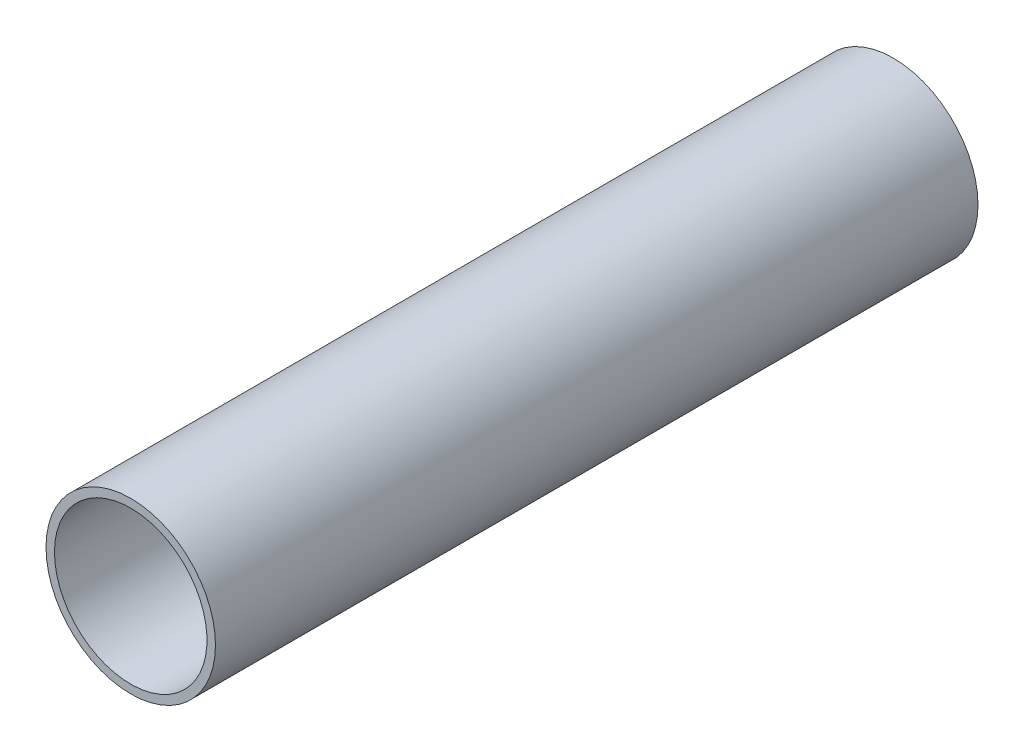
ISO-10303-21;
HEADER;
FILE_DESCRIPTION(('STEP AP214'),'2;1');
FILE_NAME('part.step','',(''),(''),'','','');
FILE_SCHEMA(('AUTOMOTIVE_DESIGN { 1 0 10303 214 1 1 1 1 }'));
ENDSEC;
DATA;
#1=APPLICATION_CONTEXT('core data for automotive mechanical design processes');
#2=APPLICATION_PROTOCOL_DEFINITION('international standard','automotive_design',2000,#1);
#3=PRODUCT_CONTEXT('',#1,'mechanical');
#4=PRODUCT('Part','Part','',(#3));
#5=PRODUCT_RELATED_PRODUCT_CATEGORY('part','',(#4));
#6=PRODUCT_DEFINITION_FORMATION('','',#4);
#7=PRODUCT_DEFINITION_CONTEXT('part definition',#1,'design');
#8=PRODUCT_DEFINITION('design','',#6,#7);
#9=PRODUCT_DEFINITION_SHAPE('','',#8);
#10=(LENGTH_UNIT() NAMED_UNIT(*) SI_UNIT(.MILLI.,.METRE.));
#11=(NAMED_UNIT(*) PLANE_ANGLE_UNIT() SI_UNIT($,.RADIAN.));
#12=(NAMED_UNIT(*) SI_UNIT($,.STERADIAN.) SOLID_ANGLE_UNIT());
#13=UNCERTAINTY_MEASURE_WITH_UNIT(LENGTH_MEASURE(1.E-05),#10,'distance_accuracy_value','');
#14=(GEOMETRIC_REPRESENTATION_CONTEXT(3) GLOBAL_UNCERTAINTY_ASSIGNED_CONTEXT((#13)) GLOBAL_UNIT_ASSIGNED_CONTEXT((#10,
#11,#12)) REPRESENTATION_CONTEXT('',''));
#15=CARTESIAN_POINT('',(0.,0.,0.));
#16=DIRECTION('',(0.,0.,1.));
#17=DIRECTION('',(1.,0.,0.));
#18=AXIS2_PLACEMENT_3D('',#15,#16,#17);
#19=CARTESIAN_POINT('',(0.,0.,22.5));
#20=DIRECTION('',(0.,0.,1.));
#21=DIRECTION('',(1.,0.,0.));
#22=AXIS2_PLACEMENT_3D('',#19,#20,#21);
#23=PLANE('',#22);
#24=CARTESIAN_POINT('',(0.,0.,22.5));
#25=DIRECTION('',(0.,0.,1.));
#26=DIRECTION('',(1.,0.,0.));
#27=AXIS2_PLACEMENT_3D('',#24,#25,#26);
#28=CIRCLE('',#27,5.);
#29=CARTESIAN_POINT('',(-5.,0.,22.5));
#30=VERTEX_POINT('',#29);
#31=EDGE_CURVE('E10',#30,#30,#28,.T.);
#32=ORIENTED_EDGE('',*,*,#31,.T.);
#33=EDGE_LOOP('',(#32));
#34=FACE_BOUND('',#33,.T.);
#35=CARTESIAN_POINT('',(0.,0.,22.5));
#36=DIRECTION('',(0.,0.,1.));
#37=DIRECTION('',(1.,0.,0.));
#38=AXIS2_PLACEMENT_3D('',#35,#36,#37);
#39=CIRCLE('',#38,4.5);
#40=CARTESIAN_POINT('',(-4.5,0.,22.5));
#41=VERTEX_POINT('',#40);
#42=EDGE_CURVE('E38',#41,#41,#39,.T.);
#43=ORIENTED_EDGE('',*,*,#42,.F.);
#44=EDGE_LOOP('',(#43));
#45=FACE_BOUND('',#44,.T.);
#46=ADVANCED_FACE('F31',(#34,#45),#23,.T.);
#47=CARTESIAN_POINT('',(0.,0.,22.5));
#48=DIRECTION('',(0.,0.,-1.));
#49=DIRECTION('',(-1.,0.,0.));
#50=AXIS2_PLACEMENT_3D('',#47,#48,#49);
#51=CYLINDRICAL_SURFACE('',#50,5.);
#52=CARTESIAN_POINT('',(0.,0.,-22.5));
#53=DIRECTION('',(0.,0.,1.));
#54=DIRECTION('',(1.,0.,0.));
#55=AXIS2_PLACEMENT_3D('',#52,#53,#54);
#56=CIRCLE('',#55,5.);
#57=CARTESIAN_POINT('',(-5.,0.,-22.5));
#58=VERTEX_POINT('',#57);
#59=EDGE_CURVE('E42',#58,#58,#56,.T.);
#60=CARTESIAN_POINT('',(-5.,0.,22.5));
#61=CARTESIAN_POINT('',(-5.,0.,22.03125));
#62=CARTESIAN_POINT('',(-5.,0.,21.5625));
#63=CARTESIAN_POINT('',(-5.,0.,20.625));
#64=CARTESIAN_POINT('',(-5.,0.,20.15625));
#65=CARTESIAN_POINT('',(-5.,0.,19.21875));
#66=CARTESIAN_POINT('',(-5.,0.,18.75));
#67=CARTESIAN_POINT('',(-5.,0.,17.8125));
#68=CARTESIAN_POINT('',(-5.,0.,17.34375));
#69=CARTESIAN_POINT('',(-5.,0.,16.40625));
#70=CARTESIAN_POINT('',(-5.,0.,15.9375));
#71=CARTESIAN_POINT('',(-5.,0.,15.));
#72=CARTESIAN_POINT('',(-5.,0.,14.53125));
#73=CARTESIAN_POINT('',(-5.,0.,13.59375));
#74=CARTESIAN_POINT('',(-5.,0.,13.125));
#75=CARTESIAN_POINT('',(-5.,0.,12.1875));
#76=CARTESIAN_POINT('',(-5.,0.,11.71875));
#77=CARTESIAN_POINT('',(-5.,0.,10.78125));
#78=CARTESIAN_POINT('',(-5.,0.,10.3125));
#79=CARTESIAN_POINT('',(-5.,0.,9.37499999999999));
#80=CARTESIAN_POINT('',(-5.,0.,8.90625));
#81=CARTESIAN_POINT('',(-5.,0.,7.96874999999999));
#82=CARTESIAN_POINT('',(-5.,0.,7.5));
#83=CARTESIAN_POINT('',(-5.,0.,6.5625));
#84=CARTESIAN_POINT('',(-5.,0.,6.09374999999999));
#85=CARTESIAN_POINT('',(-5.,0.,5.15624999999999));
#86=CARTESIAN_POINT('',(-5.,0.,4.68749999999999));
#87=CARTESIAN_POINT('',(-5.,0.,3.74999999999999));
#88=CARTESIAN_POINT('',(-5.,0.,3.28124999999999));
#89=CARTESIAN_POINT('',(-5.,0.,2.34375));
#90=CARTESIAN_POINT('',(-5.,0.,1.87499999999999));
#91=CARTESIAN_POINT('',(-5.,0.,0.937499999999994));
#92=CARTESIAN_POINT('',(-5.,0.,0.468749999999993));
#93=CARTESIAN_POINT('',(-5.,0.,-0.468750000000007));
#94=CARTESIAN_POINT('',(-5.,0.,-0.937500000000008));
#95=CARTESIAN_POINT('',(-5.,0.,-1.87500000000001));
#96=CARTESIAN_POINT('',(-5.,0.,-2.34375000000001));
#97=CARTESIAN_POINT('',(-5.,0.,-3.28125000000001));
#98=CARTESIAN_POINT('',(-5.,0.,-3.75000000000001));
#99=CARTESIAN_POINT('',(-5.,0.,-4.68750000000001));
#100=CARTESIAN_POINT('',(-5.,0.,-5.15625000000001));
#101=CARTESIAN_POINT('',(-5.,0.,-6.09375000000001));
#102=CARTESIAN_POINT('',(-5.,0.,-6.56250000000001));
#103=CARTESIAN_POINT('',(-5.,0.,-7.50000000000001));
#104=CARTESIAN_POINT('',(-5.,0.,-7.96875000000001));
#105=CARTESIAN_POINT('',(-5.,0.,-8.90625000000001));
#106=CARTESIAN_POINT('',(-5.,0.,-9.37500000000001));
#107=CARTESIAN_POINT('',(-5.,0.,-10.3125));
#108=CARTESIAN_POINT('',(-5.,0.,-10.78125));
#109=CARTESIAN_POINT('',(-5.,0.,-11.71875));
#110=CARTESIAN_POINT('',(-5.,0.,-12.1875));
#111=CARTESIAN_POINT('',(-5.,0.,-13.125));
#112=CARTESIAN_POINT('',(-5.,0.,-13.59375));
#113=CARTESIAN_POINT('',(-5.,0.,-14.53125));
#114=CARTESIAN_POINT('',(-5.,0.,-15.));
#115=CARTESIAN_POINT('',(-5.,0.,-15.9375));
#116=CARTESIAN_POINT('',(-5.,0.,-16.40625));
#117=CARTESIAN_POINT('',(-5.,0.,-17.34375));
#118=CARTESIAN_POINT('',(-5.,0.,-17.8125));
#119=CARTESIAN_POINT('',(-5.,0.,-18.75));
#120=CARTESIAN_POINT('',(-5.,0.,-19.21875));
#121=CARTESIAN_POINT('',(-5.,0.,-20.15625));
#122=CARTESIAN_POINT('',(-5.,0.,-20.625));
#123=CARTESIAN_POINT('',(-5.,0.,-21.5625));
#124=CARTESIAN_POINT('',(-5.,0.,-22.03125));
#125=CARTESIAN_POINT('',(-5.,0.,-22.5));
#126=B_SPLINE_CURVE_WITH_KNOTS('',3,(#60,#61,#62,#63,#64,#65,#66,#67,#68,#69,#70,#71,#72,#73,
#74,#75,#76,#77,#78,#79,#80,#81,#82,#83,#84,#85,#86,#87,#88,#89,#90,#91,#92,#93,#94,#95,#96,#97,
#98,#99,#100,#101,#102,#103,#104,#105,#106,#107,#108,#109,#110,#111,#112,#113,#114,#115,#116,
#117,#118,#119,#120,#121,#122,#123,#124,#125),.UNSPECIFIED.,.F.,.F.,(4,2,2,2,2,2,2,2,2,2,2,2,2,
2,2,2,2,2,2,2,2,2,2,2,2,2,2,2,2,2,2,2,4),(0.,1.40625,2.8125,4.21875,5.625,7.03125,8.4375,
9.84375,11.25,12.65625,14.0625,15.46875,16.875,18.28125,19.6875,21.09375,22.5,23.90625,25.3125,
26.71875,28.125,29.53125,30.9375,32.34375,33.75,35.15625,36.5625,37.96875,39.375,40.78125,
42.1875,43.59375,45.),.UNSPECIFIED.);
#127=EDGE_CURVE('BSEAM33',#30,#58,#126,.T.);
#128=ORIENTED_EDGE('',*,*,#31,.F.);
#129=ORIENTED_EDGE('',*,*,#59,.T.);
#130=ORIENTED_EDGE('',*,*,#127,.T.);
#131=ORIENTED_EDGE('',*,*,#127,.F.);
#132=EDGE_LOOP('',(#128,#130,#129,#131));
#133=FACE_BOUND('',#132,.T.);
#134=ADVANCED_FACE('F33',(#133),#51,.T.);
#135=CARTESIAN_POINT('',(0.,0.,22.5));
#136=DIRECTION('',(0.,0.,-1.));
#137=DIRECTION('',(-1.,0.,0.));
#138=AXIS2_PLACEMENT_3D('',#135,#136,#137);
#139=CYLINDRICAL_SURFACE('',#138,4.5);
#140=CARTESIAN_POINT('',(0.,0.,-22.5));
#141=DIRECTION('',(0.,0.,1.));
#142=DIRECTION('',(1.,0.,0.));
#143=AXIS2_PLACEMENT_3D('',#140,#141,#142);
#144=CIRCLE('',#143,4.5);
#145=CARTESIAN_POINT('',(-4.5,0.,-22.5));
#146=VERTEX_POINT('',#145);
#147=EDGE_CURVE('E46',#146,#146,#144,.T.);
#148=CARTESIAN_POINT('',(-4.5,0.,22.5));
#149=CARTESIAN_POINT('',(-4.5,0.,22.03125));
#150=CARTESIAN_POINT('',(-4.5,0.,21.5625));
#151=CARTESIAN_POINT('',(-4.5,0.,20.625));
#152=CARTESIAN_POINT('',(-4.5,0.,20.15625));
#153=CARTESIAN_POINT('',(-4.5,0.,19.21875));
#154=CARTESIAN_POINT('',(-4.5,0.,18.75));
#155=CARTESIAN_POINT('',(-4.5,0.,17.8125));
#156=CARTESIAN_POINT('',(-4.5,0.,17.34375));
#157=CARTESIAN_POINT('',(-4.5,0.,16.40625));
#158=CARTESIAN_POINT('',(-4.5,0.,15.9375));
#159=CARTESIAN_POINT('',(-4.5,0.,15.));
#160=CARTESIAN_POINT('',(-4.5,0.,14.53125));
#161=CARTESIAN_POINT('',(-4.5,0.,13.59375));
#162=CARTESIAN_POINT('',(-4.5,0.,13.125));
#163=CARTESIAN_POINT('',(-4.5,0.,12.1875));
#164=CARTESIAN_POINT('',(-4.5,0.,11.71875));
#165=CARTESIAN_POINT('',(-4.5,0.,10.78125));
#166=CARTESIAN_POINT('',(-4.5,0.,10.3125));
#167=CARTESIAN_POINT('',(-4.5,0.,9.37499999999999));
#168=CARTESIAN_POINT('',(-4.5,0.,8.90625));
#169=CARTESIAN_POINT('',(-4.5,0.,7.96874999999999));
#170=CARTESIAN_POINT('',(-4.5,0.,7.5));
#171=CARTESIAN_POINT('',(-4.5,0.,6.5625));
#172=CARTESIAN_POINT('',(-4.5,0.,6.09375));
#173=CARTESIAN_POINT('',(-4.5,0.,5.15625));
#174=CARTESIAN_POINT('',(-4.5,0.,4.6875));
#175=CARTESIAN_POINT('',(-4.5,0.,3.75));
#176=CARTESIAN_POINT('',(-4.5,0.,3.28125));
#177=CARTESIAN_POINT('',(-4.5,0.,2.34375));
#178=CARTESIAN_POINT('',(-4.5,0.,1.875));
#179=CARTESIAN_POINT('',(-4.5,0.,0.937499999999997));
#180=CARTESIAN_POINT('',(-4.5,0.,0.468749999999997));
#181=CARTESIAN_POINT('',(-4.5,0.,-0.468750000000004));
#182=CARTESIAN_POINT('',(-4.5,0.,-0.937500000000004));
#183=CARTESIAN_POINT('',(-4.5,0.,-1.87500000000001));
#184=CARTESIAN_POINT('',(-4.5,0.,-2.34375000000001));
#185=CARTESIAN_POINT('',(-4.5,0.,-3.28125));
#186=CARTESIAN_POINT('',(-4.5,0.,-3.75));
#187=CARTESIAN_POINT('',(-4.5,0.,-4.6875));
#188=CARTESIAN_POINT('',(-4.5,0.,-5.15625));
#189=CARTESIAN_POINT('',(-4.5,0.,-6.09375000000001));
#190=CARTESIAN_POINT('',(-4.5,0.,-6.56250000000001));
#191=CARTESIAN_POINT('',(-4.5,0.,-7.50000000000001));
#192=CARTESIAN_POINT('',(-4.5,0.,-7.96875000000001));
#193=CARTESIAN_POINT('',(-4.5,0.,-8.90625));
#194=CARTESIAN_POINT('',(-4.5,0.,-9.37500000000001));
#195=CARTESIAN_POINT('',(-4.5,0.,-10.3125));
#196=CARTESIAN_POINT('',(-4.5,0.,-10.78125));
#197=CARTESIAN_POINT('',(-4.5,0.,-11.71875));
#198=CARTESIAN_POINT('',(-4.5,0.,-12.1875));
#199=CARTESIAN_POINT('',(-4.5,0.,-13.125));
#200=CARTESIAN_POINT('',(-4.5,0.,-13.59375));
#201=CARTESIAN_POINT('',(-4.5,0.,-14.53125));
#202=CARTESIAN_POINT('',(-4.5,0.,-15.));
#203=CARTESIAN_POINT('',(-4.5,0.,-15.9375));
#204=CARTESIAN_POINT('',(-4.5,0.,-16.40625));
#205=CARTESIAN_POINT('',(-4.5,0.,-17.34375));
#206=CARTESIAN_POINT('',(-4.5,0.,-17.8125));
#207=CARTESIAN_POINT('',(-4.5,0.,-18.75));
#208=CARTESIAN_POINT('',(-4.5,0.,-19.21875));
#209=CARTESIAN_POINT('',(-4.5,0.,-20.15625));
#210=CARTESIAN_POINT('',(-4.5,0.,-20.625));
#211=CARTESIAN_POINT('',(-4.5,0.,-21.5625));
#212=CARTESIAN_POINT('',(-4.5,0.,-22.03125));
#213=CARTESIAN_POINT('',(-4.5,0.,-22.5));
#214=B_SPLINE_CURVE_WITH_KNOTS('',3,(#148,#149,#150,#151,#152,#153,#154,#155,#156,#157,#158,
#159,#160,#161,#162,#163,#164,#165,#166,#167,#168,#169,#170,#171,#172,#173,#174,#175,#176,#177,
#178,#179,#180,#181,#182,#183,#184,#185,#186,#187,#188,#189,#190,#191,#192,#193,#194,#195,#196,
#197,#198,#199,#200,#201,#202,#203,#204,#205,#206,#207,#208,#209,#210,#211,#212,#213),
.UNSPECIFIED.,.F.,.F.,(4,2,2,2,2,2,2,2,2,2,2,2,2,2,2,2,2,2,2,2,2,2,2,2,2,2,2,2,2,2,2,2,4),(0.,
1.40625,2.8125,4.21875,5.625,7.03125,8.4375,9.84375,11.25,12.65625,14.0625,15.46875,16.875,
18.28125,19.6875,21.09375,22.5,23.90625,25.3125,26.71875,28.125,29.53125,30.9375,32.34375,33.75,
35.15625,36.5625,37.96875,39.375,40.78125,42.1875,43.59375,45.),.UNSPECIFIED.);
#215=EDGE_CURVE('BSEAM55',#41,#146,#214,.T.);
#216=ORIENTED_EDGE('',*,*,#42,.T.);
#217=ORIENTED_EDGE('',*,*,#147,.F.);
#218=ORIENTED_EDGE('',*,*,#215,.T.);
#219=ORIENTED_EDGE('',*,*,#215,.F.);
#220=EDGE_LOOP('',(#216,#218,#217,#219));
#221=FACE_BOUND('',#220,.T.);
#222=ADVANCED_FACE('F55',(#221),#139,.F.);
#223=CARTESIAN_POINT('',(0.,0.,-22.5));
#224=DIRECTION('',(0.,0.,1.));
#225=DIRECTION('',(1.,0.,0.));
#226=AXIS2_PLACEMENT_3D('',#223,#224,#225);
#227=PLANE('',#226);
#228=ORIENTED_EDGE('',*,*,#147,.T.);
#229=EDGE_LOOP('',(#228));
#230=FACE_BOUND('',#229,.T.);
#231=ORIENTED_EDGE('',*,*,#59,.F.);
#232=EDGE_LOOP('',(#231));
#233=FACE_BOUND('',#232,.T.);
#234=ADVANCED_FACE('F52',(#230,#233),#227,.F.);
#235=CLOSED_SHELL('',(#46,#134,#222,#234));
#236=MANIFOLD_SOLID_BREP('B2',#235);
#237=ADVANCED_BREP_SHAPE_REPRESENTATION('',(#18,#236),#14);
#238=SHAPE_DEFINITION_REPRESENTATION(#9,#237);
ENDSEC;
END-ISO-10303-21;
